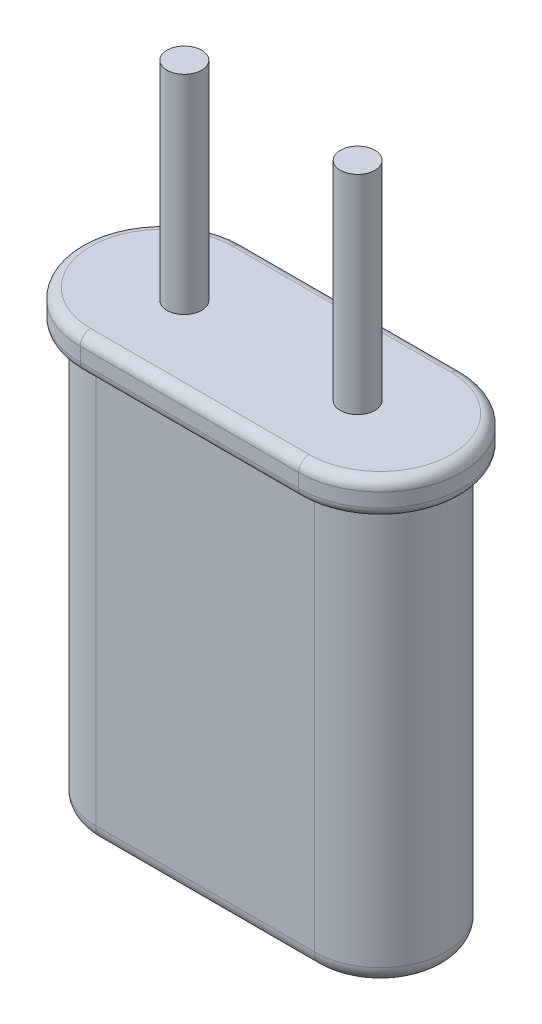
ISO-10303-21;
HEADER;
FILE_DESCRIPTION(('STEP AP214'),'2;1');
FILE_NAME('part.step','',(''),(''),'','','');
FILE_SCHEMA(('AUTOMOTIVE_DESIGN { 1 0 10303 214 1 1 1 1 }'));
ENDSEC;
DATA;
#1=APPLICATION_CONTEXT('core data for automotive mechanical design processes');
#2=APPLICATION_PROTOCOL_DEFINITION('international standard','automotive_design',2000,#1);
#3=PRODUCT_CONTEXT('',#1,'mechanical');
#4=PRODUCT('Part','Part','',(#3));
#5=PRODUCT_RELATED_PRODUCT_CATEGORY('part','',(#4));
#6=PRODUCT_DEFINITION_FORMATION('','',#4);
#7=PRODUCT_DEFINITION_CONTEXT('part definition',#1,'design');
#8=PRODUCT_DEFINITION('design','',#6,#7);
#9=PRODUCT_DEFINITION_SHAPE('','',#8);
#10=(LENGTH_UNIT() NAMED_UNIT(*) SI_UNIT(.MILLI.,.METRE.));
#11=(NAMED_UNIT(*) PLANE_ANGLE_UNIT() SI_UNIT($,.RADIAN.));
#12=(NAMED_UNIT(*) SI_UNIT($,.STERADIAN.) SOLID_ANGLE_UNIT());
#13=UNCERTAINTY_MEASURE_WITH_UNIT(LENGTH_MEASURE(1.E-05),#10,'distance_accuracy_value','');
#14=(GEOMETRIC_REPRESENTATION_CONTEXT(3) GLOBAL_UNCERTAINTY_ASSIGNED_CONTEXT((#13)) GLOBAL_UNIT_ASSIGNED_CONTEXT((#10,
#11,#12)) REPRESENTATION_CONTEXT('',''));
#15=CARTESIAN_POINT('',(0.,0.,0.));
#16=DIRECTION('',(0.,0.,1.));
#17=DIRECTION('',(1.,0.,0.));
#18=AXIS2_PLACEMENT_3D('',#15,#16,#17);
#19=CARTESIAN_POINT('',(3.15,0.,0.));
#20=DIRECTION('',(0.,1.,0.));
#21=DIRECTION('',(0.,0.,1.));
#22=AXIS2_PLACEMENT_3D('',#19,#20,#21);
#23=PLANE('',#22);
#24=CARTESIAN_POINT('',(-2.5,0.,0.));
#25=DIRECTION('',(0.,1.,0.));
#26=DIRECTION('',(0.,0.,1.));
#27=AXIS2_PLACEMENT_3D('',#24,#25,#26);
#28=CIRCLE('',#27,0.5);
#29=CARTESIAN_POINT('',(-2.5,0.,0.5));
#30=VERTEX_POINT('',#29);
#31=EDGE_CURVE('E272',#30,#30,#28,.T.);
#32=ORIENTED_EDGE('',*,*,#31,.F.);
#33=EDGE_LOOP('',(#32));
#34=FACE_BOUND('',#33,.T.);
#35=CARTESIAN_POINT('',(-3.15,0.,0.));
#36=DIRECTION('',(0.,1.,0.));
#37=DIRECTION('',(0.,0.,1.));
#38=AXIS2_PLACEMENT_3D('',#35,#36,#37);
#39=CIRCLE('',#38,2.05);
#40=CARTESIAN_POINT('',(-3.15,0.,-2.05));
#41=VERTEX_POINT('',#40);
#42=CARTESIAN_POINT('',(-3.15,0.,2.05));
#43=VERTEX_POINT('',#42);
#44=EDGE_CURVE('E183',#41,#43,#39,.T.);
#45=ORIENTED_EDGE('',*,*,#44,.T.);
#46=DIRECTION('',(1.,0.,0.));
#47=VECTOR('',#46,1.);
#48=CARTESIAN_POINT('',(3.15,0.,2.05));
#49=LINE('',#48,#47);
#50=CARTESIAN_POINT('',(3.15,0.,2.05));
#51=VERTEX_POINT('',#50);
#52=EDGE_CURVE('E185',#43,#51,#49,.T.);
#53=ORIENTED_EDGE('',*,*,#52,.T.);
#54=CARTESIAN_POINT('',(3.15,0.,0.));
#55=DIRECTION('',(0.,1.,0.));
#56=DIRECTION('',(0.,0.,1.));
#57=AXIS2_PLACEMENT_3D('',#54,#55,#56);
#58=CIRCLE('',#57,2.05);
#59=CARTESIAN_POINT('',(3.15,0.,-2.05));
#60=VERTEX_POINT('',#59);
#61=EDGE_CURVE('E171',#51,#60,#58,.T.);
#62=ORIENTED_EDGE('',*,*,#61,.T.);
#63=DIRECTION('',(-1.,0.,0.));
#64=VECTOR('',#63,1.);
#65=CARTESIAN_POINT('',(3.15,0.,-2.05));
#66=LINE('',#65,#64);
#67=EDGE_CURVE('E181',#60,#41,#66,.T.);
#68=ORIENTED_EDGE('',*,*,#67,.T.);
#69=EDGE_LOOP('',(#45,#53,#62,#68));
#70=FACE_BOUND('',#69,.T.);
#71=CARTESIAN_POINT('',(2.5,0.,0.));
#72=DIRECTION('',(0.,1.,0.));
#73=DIRECTION('',(0.,0.,-1.));
#74=AXIS2_PLACEMENT_3D('',#71,#72,#73);
#75=CIRCLE('',#74,0.5);
#76=CARTESIAN_POINT('',(2.5,0.,-0.5));
#77=VERTEX_POINT('',#76);
#78=EDGE_CURVE('E278',#77,#77,#75,.T.);
#79=ORIENTED_EDGE('',*,*,#78,.F.);
#80=EDGE_LOOP('',(#79));
#81=FACE_BOUND('',#80,.T.);
#82=ADVANCED_FACE('F32',(#34,#70,#81),#23,.T.);
#83=CARTESIAN_POINT('',(3.15,-1.,0.));
#84=DIRECTION('',(0.,1.,0.));
#85=DIRECTION('',(0.,0.,1.));
#86=AXIS2_PLACEMENT_3D('',#83,#84,#85);
#87=PLANE('',#86);
#88=CARTESIAN_POINT('',(3.15,-1.,0.));
#89=DIRECTION('',(0.,1.,0.));
#90=DIRECTION('',(0.,0.,1.));
#91=AXIS2_PLACEMENT_3D('',#88,#89,#90);
#92=CIRCLE('',#91,2.05);
#93=CARTESIAN_POINT('',(3.15,-1.,-2.05));
#94=VERTEX_POINT('',#93);
#95=CARTESIAN_POINT('',(3.15,-1.,2.05));
#96=VERTEX_POINT('',#95);
#97=EDGE_CURVE('E208',#94,#96,#92,.F.);
#98=ORIENTED_EDGE('',*,*,#97,.T.);
#99=DIRECTION('',(1.,0.,0.));
#100=VECTOR('',#99,1.);
#101=CARTESIAN_POINT('',(-3.15,-1.,2.05));
#102=LINE('',#101,#100);
#103=CARTESIAN_POINT('',(-3.15,-1.,2.05));
#104=VERTEX_POINT('',#103);
#105=EDGE_CURVE('E213',#96,#104,#102,.F.);
#106=ORIENTED_EDGE('',*,*,#105,.T.);
#107=CARTESIAN_POINT('',(-3.15,-1.,0.));
#108=DIRECTION('',(0.,1.,0.));
#109=DIRECTION('',(0.,0.,1.));
#110=AXIS2_PLACEMENT_3D('',#107,#108,#109);
#111=CIRCLE('',#110,2.05);
#112=CARTESIAN_POINT('',(-3.15,-1.,-2.05));
#113=VERTEX_POINT('',#112);
#114=EDGE_CURVE('E210',#104,#113,#111,.F.);
#115=ORIENTED_EDGE('',*,*,#114,.T.);
#116=DIRECTION('',(-1.,0.,0.));
#117=VECTOR('',#116,1.);
#118=CARTESIAN_POINT('',(3.15,-1.,-2.05));
#119=LINE('',#118,#117);
#120=EDGE_CURVE('E206',#113,#94,#119,.F.);
#121=ORIENTED_EDGE('',*,*,#120,.T.);
#122=EDGE_LOOP('',(#98,#106,#115,#121));
#123=FACE_BOUND('',#122,.T.);
#124=CARTESIAN_POINT('',(3.15,-1.,0.));
#125=DIRECTION('',(0.,-1.,0.));
#126=DIRECTION('',(0.,0.,-1.));
#127=AXIS2_PLACEMENT_3D('',#124,#125,#126);
#128=CIRCLE('',#127,1.9);
#129=CARTESIAN_POINT('',(3.15,-1.,-1.9));
#130=VERTEX_POINT('',#129);
#131=CARTESIAN_POINT('',(3.15,-1.,1.9));
#132=VERTEX_POINT('',#131);
#133=EDGE_CURVE('E137',#130,#132,#128,.T.);
#134=ORIENTED_EDGE('',*,*,#133,.F.);
#135=DIRECTION('',(1.,0.,0.));
#136=VECTOR('',#135,1.);
#137=CARTESIAN_POINT('',(-3.15,-1.,-1.9));
#138=LINE('',#137,#136);
#139=CARTESIAN_POINT('',(-3.15,-1.,-1.9));
#140=VERTEX_POINT('',#139);
#141=EDGE_CURVE('E144',#140,#130,#138,.T.);
#142=ORIENTED_EDGE('',*,*,#141,.F.);
#143=CARTESIAN_POINT('',(-3.15,-1.,0.));
#144=DIRECTION('',(0.,-1.,0.));
#145=DIRECTION('',(0.,0.,-1.));
#146=AXIS2_PLACEMENT_3D('',#143,#144,#145);
#147=CIRCLE('',#146,1.9);
#148=CARTESIAN_POINT('',(-3.15,-1.,1.9));
#149=VERTEX_POINT('',#148);
#150=EDGE_CURVE('E157',#149,#140,#147,.T.);
#151=ORIENTED_EDGE('',*,*,#150,.F.);
#152=DIRECTION('',(-1.,0.,0.));
#153=VECTOR('',#152,1.);
#154=CARTESIAN_POINT('',(3.15,-1.,1.9));
#155=LINE('',#154,#153);
#156=EDGE_CURVE('E153',#132,#149,#155,.T.);
#157=ORIENTED_EDGE('',*,*,#156,.F.);
#158=EDGE_LOOP('',(#134,#142,#151,#157));
#159=FACE_BOUND('',#158,.T.);
#160=ADVANCED_FACE('F149',(#123,#159),#87,.F.);
#161=CARTESIAN_POINT('',(3.15,-1.,0.));
#162=DIRECTION('',(0.,1.,0.));
#163=DIRECTION('',(0.,0.,1.));
#164=AXIS2_PLACEMENT_3D('',#161,#162,#163);
#165=CYLINDRICAL_SURFACE('',#164,2.35);
#166=DIRECTION('',(0.,1.,0.));
#167=VECTOR('',#166,1.);
#168=CARTESIAN_POINT('',(3.15,-1.,-2.35));
#169=LINE('',#168,#167);
#170=CARTESIAN_POINT('',(3.15,-0.7,-2.35));
#171=VERTEX_POINT('',#170);
#172=CARTESIAN_POINT('',(3.15,-0.3,-2.35));
#173=VERTEX_POINT('',#172);
#174=EDGE_CURVE('E167',#171,#173,#169,.T.);
#175=ORIENTED_EDGE('',*,*,#174,.T.);
#176=CARTESIAN_POINT('',(3.15,-0.3,0.));
#177=DIRECTION('',(0.,1.,0.));
#178=DIRECTION('',(0.,0.,1.));
#179=AXIS2_PLACEMENT_3D('',#176,#177,#178);
#180=CIRCLE('',#179,2.35);
#181=CARTESIAN_POINT('',(3.15,-0.3,2.35));
#182=VERTEX_POINT('',#181);
#183=EDGE_CURVE('E204',#173,#182,#180,.F.);
#184=ORIENTED_EDGE('',*,*,#183,.T.);
#185=DIRECTION('',(0.,1.,0.));
#186=VECTOR('',#185,1.);
#187=CARTESIAN_POINT('',(3.15,-1.,2.35));
#188=LINE('',#187,#186);
#189=CARTESIAN_POINT('',(3.15,-0.7,2.35));
#190=VERTEX_POINT('',#189);
#191=EDGE_CURVE('E168',#190,#182,#188,.T.);
#192=ORIENTED_EDGE('',*,*,#191,.F.);
#193=CARTESIAN_POINT('',(3.15,-0.7,0.));
#194=DIRECTION('',(0.,1.,0.));
#195=DIRECTION('',(0.,0.,1.));
#196=AXIS2_PLACEMENT_3D('',#193,#194,#195);
#197=CIRCLE('',#196,2.35);
#198=EDGE_CURVE('E202',#190,#171,#197,.T.);
#199=ORIENTED_EDGE('',*,*,#198,.T.);
#200=EDGE_LOOP('',(#175,#184,#192,#199));
#201=FACE_BOUND('',#200,.T.);
#202=ADVANCED_FACE('F299',(#201),#165,.T.);
#203=CARTESIAN_POINT('',(-3.15,-1.,2.35));
#204=DIRECTION('',(0.,0.,1.));
#205=DIRECTION('',(1.,0.,0.));
#206=AXIS2_PLACEMENT_3D('',#203,#204,#205);
#207=PLANE('',#206);
#208=ORIENTED_EDGE('',*,*,#191,.T.);
#209=DIRECTION('',(1.,0.,0.));
#210=VECTOR('',#209,1.);
#211=CARTESIAN_POINT('',(-3.15,-0.3,2.35));
#212=LINE('',#211,#210);
#213=CARTESIAN_POINT('',(-3.15,-0.3,2.35));
#214=VERTEX_POINT('',#213);
#215=EDGE_CURVE('E190',#182,#214,#212,.F.);
#216=ORIENTED_EDGE('',*,*,#215,.T.);
#217=DIRECTION('',(0.,1.,0.));
#218=VECTOR('',#217,1.);
#219=CARTESIAN_POINT('',(-3.15,-1.,2.35));
#220=LINE('',#219,#218);
#221=CARTESIAN_POINT('',(-3.15,-0.7,2.35));
#222=VERTEX_POINT('',#221);
#223=EDGE_CURVE('E172',#222,#214,#220,.T.);
#224=ORIENTED_EDGE('',*,*,#223,.F.);
#225=DIRECTION('',(1.,0.,0.));
#226=VECTOR('',#225,1.);
#227=CARTESIAN_POINT('',(3.15,-0.7,2.35));
#228=LINE('',#227,#226);
#229=EDGE_CURVE('E188',#222,#190,#228,.T.);
#230=ORIENTED_EDGE('',*,*,#229,.T.);
#231=EDGE_LOOP('',(#208,#216,#224,#230));
#232=FACE_BOUND('',#231,.T.);
#233=ADVANCED_FACE('F306',(#232),#207,.T.);
#234=CARTESIAN_POINT('',(-3.15,-1.,0.));
#235=DIRECTION('',(0.,1.,0.));
#236=DIRECTION('',(0.,0.,1.));
#237=AXIS2_PLACEMENT_3D('',#234,#235,#236);
#238=CYLINDRICAL_SURFACE('',#237,2.35);
#239=ORIENTED_EDGE('',*,*,#223,.T.);
#240=CARTESIAN_POINT('',(-3.15,-0.3,0.));
#241=DIRECTION('',(0.,1.,0.));
#242=DIRECTION('',(0.,0.,1.));
#243=AXIS2_PLACEMENT_3D('',#240,#241,#242);
#244=CIRCLE('',#243,2.35);
#245=CARTESIAN_POINT('',(-3.15,-0.3,-2.35));
#246=VERTEX_POINT('',#245);
#247=EDGE_CURVE('E196',#214,#246,#244,.F.);
#248=ORIENTED_EDGE('',*,*,#247,.T.);
#249=DIRECTION('',(0.,1.,0.));
#250=VECTOR('',#249,1.);
#251=CARTESIAN_POINT('',(-3.15,-1.,-2.35));
#252=LINE('',#251,#250);
#253=CARTESIAN_POINT('',(-3.15,-0.7,-2.35));
#254=VERTEX_POINT('',#253);
#255=EDGE_CURVE('E175',#254,#246,#252,.T.);
#256=ORIENTED_EDGE('',*,*,#255,.F.);
#257=CARTESIAN_POINT('',(-3.15,-0.7,0.));
#258=DIRECTION('',(0.,1.,0.));
#259=DIRECTION('',(0.,0.,1.));
#260=AXIS2_PLACEMENT_3D('',#257,#258,#259);
#261=CIRCLE('',#260,2.35);
#262=EDGE_CURVE('E193',#254,#222,#261,.T.);
#263=ORIENTED_EDGE('',*,*,#262,.T.);
#264=EDGE_LOOP('',(#239,#248,#256,#263));
#265=FACE_BOUND('',#264,.T.);
#266=ADVANCED_FACE('F309',(#265),#238,.T.);
#267=CARTESIAN_POINT('',(-3.15,-1.,-2.35));
#268=DIRECTION('',(0.,0.,-1.));
#269=DIRECTION('',(-1.,0.,0.));
#270=AXIS2_PLACEMENT_3D('',#267,#268,#269);
#271=PLANE('',#270);
#272=ORIENTED_EDGE('',*,*,#255,.T.);
#273=DIRECTION('',(-1.,0.,0.));
#274=VECTOR('',#273,1.);
#275=CARTESIAN_POINT('',(-3.15,-0.3,-2.35));
#276=LINE('',#275,#274);
#277=EDGE_CURVE('E200',#246,#173,#276,.F.);
#278=ORIENTED_EDGE('',*,*,#277,.T.);
#279=ORIENTED_EDGE('',*,*,#174,.F.);
#280=DIRECTION('',(-1.,0.,0.));
#281=VECTOR('',#280,1.);
#282=CARTESIAN_POINT('',(-3.15,-0.7,-2.35));
#283=LINE('',#282,#281);
#284=EDGE_CURVE('E198',#171,#254,#283,.T.);
#285=ORIENTED_EDGE('',*,*,#284,.T.);
#286=EDGE_LOOP('',(#272,#278,#279,#285));
#287=FACE_BOUND('',#286,.T.);
#288=ADVANCED_FACE('F313',(#287),#271,.T.);
#289=CARTESIAN_POINT('',(3.15,-13.,0.));
#290=DIRECTION('',(0.,1.,0.));
#291=DIRECTION('',(0.,0.,1.));
#292=AXIS2_PLACEMENT_3D('',#289,#290,#291);
#293=CYLINDRICAL_SURFACE('',#292,1.9);
#294=DIRECTION('',(0.,1.,0.));
#295=VECTOR('',#294,1.);
#296=CARTESIAN_POINT('',(3.15,-13.,1.9));
#297=LINE('',#296,#295);
#298=CARTESIAN_POINT('',(3.15,-12.5,1.9));
#299=VERTEX_POINT('',#298);
#300=EDGE_CURVE('E165',#299,#132,#297,.T.);
#301=ORIENTED_EDGE('',*,*,#300,.F.);
#302=CARTESIAN_POINT('',(3.15,-12.5,0.));
#303=DIRECTION('',(0.,-1.,0.));
#304=DIRECTION('',(0.,0.,-1.));
#305=AXIS2_PLACEMENT_3D('',#302,#303,#304);
#306=CIRCLE('',#305,1.9);
#307=CARTESIAN_POINT('',(3.15,-12.5,-1.9));
#308=VERTEX_POINT('',#307);
#309=EDGE_CURVE('E11',#299,#308,#306,.F.);
#310=ORIENTED_EDGE('',*,*,#309,.T.);
#311=DIRECTION('',(0.,1.,0.));
#312=VECTOR('',#311,1.);
#313=CARTESIAN_POINT('',(3.15,-13.,-1.9));
#314=LINE('',#313,#312);
#315=EDGE_CURVE('E134',#308,#130,#314,.T.);
#316=ORIENTED_EDGE('',*,*,#315,.T.);
#317=ORIENTED_EDGE('',*,*,#133,.T.);
#318=EDGE_LOOP('',(#301,#310,#316,#317));
#319=FACE_BOUND('',#318,.T.);
#320=ADVANCED_FACE('F136',(#319),#293,.T.);
#321=CARTESIAN_POINT('',(3.15,-13.,1.9));
#322=DIRECTION('',(0.,0.,-1.));
#323=DIRECTION('',(-1.,0.,0.));
#324=AXIS2_PLACEMENT_3D('',#321,#322,#323);
#325=PLANE('',#324);
#326=DIRECTION('',(0.,1.,0.));
#327=VECTOR('',#326,1.);
#328=CARTESIAN_POINT('',(-3.15,-13.,1.9));
#329=LINE('',#328,#327);
#330=CARTESIAN_POINT('',(-3.15,-12.5,1.9));
#331=VERTEX_POINT('',#330);
#332=EDGE_CURVE('E163',#331,#149,#329,.T.);
#333=ORIENTED_EDGE('',*,*,#332,.F.);
#334=DIRECTION('',(-1.,0.,0.));
#335=VECTOR('',#334,1.);
#336=CARTESIAN_POINT('',(3.15,-12.5,1.9));
#337=LINE('',#336,#335);
#338=EDGE_CURVE('E41',#331,#299,#337,.F.);
#339=ORIENTED_EDGE('',*,*,#338,.T.);
#340=ORIENTED_EDGE('',*,*,#300,.T.);
#341=ORIENTED_EDGE('',*,*,#156,.T.);
#342=EDGE_LOOP('',(#333,#339,#340,#341));
#343=FACE_BOUND('',#342,.T.);
#344=ADVANCED_FACE('F270',(#343),#325,.F.);
#345=CARTESIAN_POINT('',(-3.15,-13.,0.));
#346=DIRECTION('',(0.,1.,0.));
#347=DIRECTION('',(0.,0.,1.));
#348=AXIS2_PLACEMENT_3D('',#345,#346,#347);
#349=CYLINDRICAL_SURFACE('',#348,1.9);
#350=DIRECTION('',(0.,1.,0.));
#351=VECTOR('',#350,1.);
#352=CARTESIAN_POINT('',(-3.15,-13.,-1.9));
#353=LINE('',#352,#351);
#354=CARTESIAN_POINT('',(-3.15,-12.5,-1.9));
#355=VERTEX_POINT('',#354);
#356=EDGE_CURVE('E143',#355,#140,#353,.T.);
#357=ORIENTED_EDGE('',*,*,#356,.F.);
#358=CARTESIAN_POINT('',(-3.15,-12.5,0.));
#359=DIRECTION('',(0.,-1.,0.));
#360=DIRECTION('',(0.,0.,-1.));
#361=AXIS2_PLACEMENT_3D('',#358,#359,#360);
#362=CIRCLE('',#361,1.9);
#363=EDGE_CURVE('E56',#355,#331,#362,.F.);
#364=ORIENTED_EDGE('',*,*,#363,.T.);
#365=ORIENTED_EDGE('',*,*,#332,.T.);
#366=ORIENTED_EDGE('',*,*,#150,.T.);
#367=EDGE_LOOP('',(#357,#364,#365,#366));
#368=FACE_BOUND('',#367,.T.);
#369=ADVANCED_FACE('F269',(#368),#349,.T.);
#370=CARTESIAN_POINT('',(-3.15,-13.,-1.9));
#371=DIRECTION('',(0.,0.,1.));
#372=DIRECTION('',(1.,0.,0.));
#373=AXIS2_PLACEMENT_3D('',#370,#371,#372);
#374=PLANE('',#373);
#375=ORIENTED_EDGE('',*,*,#315,.F.);
#376=DIRECTION('',(1.,0.,0.));
#377=VECTOR('',#376,1.);
#378=CARTESIAN_POINT('',(-3.15,-12.5,-1.9));
#379=LINE('',#378,#377);
#380=EDGE_CURVE('E243',#308,#355,#379,.F.);
#381=ORIENTED_EDGE('',*,*,#380,.T.);
#382=ORIENTED_EDGE('',*,*,#356,.T.);
#383=ORIENTED_EDGE('',*,*,#141,.T.);
#384=EDGE_LOOP('',(#375,#381,#382,#383));
#385=FACE_BOUND('',#384,.T.);
#386=ADVANCED_FACE('F156',(#385),#374,.F.);
#387=CARTESIAN_POINT('',(3.15,-13.,0.));
#388=DIRECTION('',(0.,-1.,0.));
#389=DIRECTION('',(0.,0.,-1.));
#390=AXIS2_PLACEMENT_3D('',#387,#388,#389);
#391=PLANE('',#390);
#392=CARTESIAN_POINT('',(-3.15,-13.,0.));
#393=DIRECTION('',(0.,-1.,0.));
#394=DIRECTION('',(0.,0.,-1.));
#395=AXIS2_PLACEMENT_3D('',#392,#393,#394);
#396=CIRCLE('',#395,1.4);
#397=CARTESIAN_POINT('',(-3.15,-13.,1.4));
#398=VERTEX_POINT('',#397);
#399=CARTESIAN_POINT('',(-3.15,-13.,-1.4));
#400=VERTEX_POINT('',#399);
#401=EDGE_CURVE('E238',#398,#400,#396,.T.);
#402=ORIENTED_EDGE('',*,*,#401,.T.);
#403=DIRECTION('',(1.,0.,0.));
#404=VECTOR('',#403,1.);
#405=CARTESIAN_POINT('',(3.15,-13.,-1.4));
#406=LINE('',#405,#404);
#407=CARTESIAN_POINT('',(3.15,-13.,-1.4));
#408=VERTEX_POINT('',#407);
#409=EDGE_CURVE('E240',#400,#408,#406,.T.);
#410=ORIENTED_EDGE('',*,*,#409,.T.);
#411=CARTESIAN_POINT('',(3.15,-13.,0.));
#412=DIRECTION('',(0.,-1.,0.));
#413=DIRECTION('',(0.,0.,-1.));
#414=AXIS2_PLACEMENT_3D('',#411,#412,#413);
#415=CIRCLE('',#414,1.4);
#416=CARTESIAN_POINT('',(3.15,-13.,1.4));
#417=VERTEX_POINT('',#416);
#418=EDGE_CURVE('E215',#408,#417,#415,.T.);
#419=ORIENTED_EDGE('',*,*,#418,.T.);
#420=DIRECTION('',(-1.,0.,0.));
#421=VECTOR('',#420,1.);
#422=CARTESIAN_POINT('',(-3.15,-13.,1.4));
#423=LINE('',#422,#421);
#424=EDGE_CURVE('E236',#417,#398,#423,.T.);
#425=ORIENTED_EDGE('',*,*,#424,.T.);
#426=EDGE_LOOP('',(#402,#410,#419,#425));
#427=FACE_BOUND('',#426,.T.);
#428=ADVANCED_FACE('F337',(#427),#391,.T.);
#429=CARTESIAN_POINT('',(3.15,-0.3,-2.05));
#430=DIRECTION('',(-1.,0.,0.));
#431=DIRECTION('',(0.,0.,1.));
#432=AXIS2_PLACEMENT_3D('',#429,#430,#431);
#433=CYLINDRICAL_SURFACE('',#432,0.3);
#434=CARTESIAN_POINT('',(3.15,-0.3,-2.05));
#435=DIRECTION('',(1.,0.,0.));
#436=DIRECTION('',(0.,0.,-1.));
#437=AXIS2_PLACEMENT_3D('',#434,#435,#436);
#438=CIRCLE('',#437,0.3);
#439=EDGE_CURVE('E221',#173,#60,#438,.T.);
#440=ORIENTED_EDGE('',*,*,#439,.F.);
#441=ORIENTED_EDGE('',*,*,#277,.F.);
#442=CARTESIAN_POINT('',(-3.15,-0.3,-2.05));
#443=DIRECTION('',(-1.,0.,0.));
#444=DIRECTION('',(0.,0.,1.));
#445=AXIS2_PLACEMENT_3D('',#442,#443,#444);
#446=CIRCLE('',#445,0.3);
#447=EDGE_CURVE('E154',#41,#246,#446,.T.);
#448=ORIENTED_EDGE('',*,*,#447,.F.);
#449=ORIENTED_EDGE('',*,*,#67,.F.);
#450=EDGE_LOOP('',(#440,#441,#448,#449));
#451=FACE_BOUND('',#450,.T.);
#452=ADVANCED_FACE('F333',(#451),#433,.T.);
#453=CARTESIAN_POINT('',(-3.15,-0.3,0.));
#454=DIRECTION('',(0.,1.,0.));
#455=DIRECTION('',(0.,0.,1.));
#456=AXIS2_PLACEMENT_3D('',#453,#454,#455);
#457=TOROIDAL_SURFACE('',#456,2.05,0.3);
#458=ORIENTED_EDGE('',*,*,#447,.T.);
#459=ORIENTED_EDGE('',*,*,#247,.F.);
#460=CARTESIAN_POINT('',(-3.15,-0.3,2.05));
#461=DIRECTION('',(1.,0.,0.));
#462=DIRECTION('',(0.,0.,-1.));
#463=AXIS2_PLACEMENT_3D('',#460,#461,#462);
#464=CIRCLE('',#463,0.3);
#465=EDGE_CURVE('E218',#43,#214,#464,.T.);
#466=ORIENTED_EDGE('',*,*,#465,.F.);
#467=ORIENTED_EDGE('',*,*,#44,.F.);
#468=EDGE_LOOP('',(#458,#459,#466,#467));
#469=FACE_BOUND('',#468,.T.);
#470=ADVANCED_FACE('F329',(#469),#457,.T.);
#471=CARTESIAN_POINT('',(3.15,-0.3,0.));
#472=DIRECTION('',(0.,1.,0.));
#473=DIRECTION('',(0.,0.,1.));
#474=AXIS2_PLACEMENT_3D('',#471,#472,#473);
#475=TOROIDAL_SURFACE('',#474,2.05,0.3);
#476=ORIENTED_EDGE('',*,*,#439,.T.);
#477=ORIENTED_EDGE('',*,*,#61,.F.);
#478=CARTESIAN_POINT('',(3.15,-0.3,2.05));
#479=DIRECTION('',(-1.,0.,0.));
#480=DIRECTION('',(0.,0.,1.));
#481=AXIS2_PLACEMENT_3D('',#478,#479,#480);
#482=CIRCLE('',#481,0.3);
#483=EDGE_CURVE('E216',#182,#51,#482,.T.);
#484=ORIENTED_EDGE('',*,*,#483,.F.);
#485=ORIENTED_EDGE('',*,*,#183,.F.);
#486=EDGE_LOOP('',(#476,#477,#484,#485));
#487=FACE_BOUND('',#486,.T.);
#488=ADVANCED_FACE('F325',(#487),#475,.T.);
#489=CARTESIAN_POINT('',(3.15,-0.3,2.05));
#490=DIRECTION('',(1.,0.,0.));
#491=DIRECTION('',(0.,0.,-1.));
#492=AXIS2_PLACEMENT_3D('',#489,#490,#491);
#493=CYLINDRICAL_SURFACE('',#492,0.3);
#494=ORIENTED_EDGE('',*,*,#465,.T.);
#495=ORIENTED_EDGE('',*,*,#215,.F.);
#496=ORIENTED_EDGE('',*,*,#483,.T.);
#497=ORIENTED_EDGE('',*,*,#52,.F.);
#498=EDGE_LOOP('',(#494,#495,#496,#497));
#499=FACE_BOUND('',#498,.T.);
#500=ADVANCED_FACE('F321',(#499),#493,.T.);
#501=CARTESIAN_POINT('',(3.15,-0.7,0.));
#502=DIRECTION('',(0.,1.,0.));
#503=DIRECTION('',(0.,0.,1.));
#504=AXIS2_PLACEMENT_3D('',#501,#502,#503);
#505=TOROIDAL_SURFACE('',#504,2.05,0.3);
#506=CARTESIAN_POINT('',(3.15,-0.7,2.05));
#507=DIRECTION('',(-1.,0.,0.));
#508=DIRECTION('',(0.,0.,1.));
#509=AXIS2_PLACEMENT_3D('',#506,#507,#508);
#510=CIRCLE('',#509,0.3);
#511=EDGE_CURVE('E230',#96,#190,#510,.T.);
#512=ORIENTED_EDGE('',*,*,#511,.F.);
#513=ORIENTED_EDGE('',*,*,#97,.F.);
#514=CARTESIAN_POINT('',(3.15,-0.7,-2.05));
#515=DIRECTION('',(-1.,0.,0.));
#516=DIRECTION('',(0.,0.,1.));
#517=AXIS2_PLACEMENT_3D('',#514,#515,#516);
#518=CIRCLE('',#517,0.3);
#519=EDGE_CURVE('E219',#171,#94,#518,.T.);
#520=ORIENTED_EDGE('',*,*,#519,.F.);
#521=ORIENTED_EDGE('',*,*,#198,.F.);
#522=EDGE_LOOP('',(#512,#513,#520,#521));
#523=FACE_BOUND('',#522,.T.);
#524=ADVANCED_FACE('F324',(#523),#505,.T.);
#525=CARTESIAN_POINT('',(-3.15,-0.7,-2.05));
#526=DIRECTION('',(1.,0.,0.));
#527=DIRECTION('',(0.,0.,-1.));
#528=AXIS2_PLACEMENT_3D('',#525,#526,#527);
#529=CYLINDRICAL_SURFACE('',#528,0.3);
#530=ORIENTED_EDGE('',*,*,#519,.T.);
#531=ORIENTED_EDGE('',*,*,#120,.F.);
#532=CARTESIAN_POINT('',(-3.15,-0.7,-2.05));
#533=DIRECTION('',(-1.,0.,0.));
#534=DIRECTION('',(0.,0.,1.));
#535=AXIS2_PLACEMENT_3D('',#532,#533,#534);
#536=CIRCLE('',#535,0.3);
#537=EDGE_CURVE('E228',#254,#113,#536,.T.);
#538=ORIENTED_EDGE('',*,*,#537,.F.);
#539=ORIENTED_EDGE('',*,*,#284,.F.);
#540=EDGE_LOOP('',(#530,#531,#538,#539));
#541=FACE_BOUND('',#540,.T.);
#542=ADVANCED_FACE('F346',(#541),#529,.T.);
#543=CARTESIAN_POINT('',(-3.15,-0.7,2.05));
#544=DIRECTION('',(-1.,0.,0.));
#545=DIRECTION('',(0.,0.,1.));
#546=AXIS2_PLACEMENT_3D('',#543,#544,#545);
#547=CYLINDRICAL_SURFACE('',#546,0.3);
#548=ORIENTED_EDGE('',*,*,#511,.T.);
#549=ORIENTED_EDGE('',*,*,#229,.F.);
#550=CARTESIAN_POINT('',(-3.15,-0.7,2.05));
#551=DIRECTION('',(-1.,0.,0.));
#552=DIRECTION('',(0.,0.,1.));
#553=AXIS2_PLACEMENT_3D('',#550,#551,#552);
#554=CIRCLE('',#553,0.3);
#555=EDGE_CURVE('E226',#104,#222,#554,.T.);
#556=ORIENTED_EDGE('',*,*,#555,.F.);
#557=ORIENTED_EDGE('',*,*,#105,.F.);
#558=EDGE_LOOP('',(#548,#549,#556,#557));
#559=FACE_BOUND('',#558,.T.);
#560=ADVANCED_FACE('F342',(#559),#547,.T.);
#561=CARTESIAN_POINT('',(-3.15,-0.7,0.));
#562=DIRECTION('',(0.,1.,0.));
#563=DIRECTION('',(0.,0.,1.));
#564=AXIS2_PLACEMENT_3D('',#561,#562,#563);
#565=TOROIDAL_SURFACE('',#564,2.05,0.3);
#566=ORIENTED_EDGE('',*,*,#537,.T.);
#567=ORIENTED_EDGE('',*,*,#114,.F.);
#568=ORIENTED_EDGE('',*,*,#555,.T.);
#569=ORIENTED_EDGE('',*,*,#262,.F.);
#570=EDGE_LOOP('',(#566,#567,#568,#569));
#571=FACE_BOUND('',#570,.T.);
#572=ADVANCED_FACE('F339',(#571),#565,.T.);
#573=CARTESIAN_POINT('',(3.15,-12.5,1.4));
#574=DIRECTION('',(1.,0.,0.));
#575=DIRECTION('',(0.,0.,-1.));
#576=AXIS2_PLACEMENT_3D('',#573,#574,#575);
#577=CYLINDRICAL_SURFACE('',#576,0.5);
#578=CARTESIAN_POINT('',(3.15,-12.5,1.4));
#579=DIRECTION('',(1.,0.,0.));
#580=DIRECTION('',(0.,0.,-1.));
#581=AXIS2_PLACEMENT_3D('',#578,#579,#580);
#582=CIRCLE('',#581,0.5);
#583=EDGE_CURVE('E251',#299,#417,#582,.T.);
#584=ORIENTED_EDGE('',*,*,#583,.F.);
#585=ORIENTED_EDGE('',*,*,#338,.F.);
#586=CARTESIAN_POINT('',(-3.15,-12.5,1.4));
#587=DIRECTION('',(-1.,0.,0.));
#588=DIRECTION('',(0.,0.,1.));
#589=AXIS2_PLACEMENT_3D('',#586,#587,#588);
#590=CIRCLE('',#589,0.5);
#591=EDGE_CURVE('E36',#398,#331,#590,.T.);
#592=ORIENTED_EDGE('',*,*,#591,.F.);
#593=ORIENTED_EDGE('',*,*,#424,.F.);
#594=EDGE_LOOP('',(#584,#585,#592,#593));
#595=FACE_BOUND('',#594,.T.);
#596=ADVANCED_FACE('F34',(#595),#577,.T.);
#597=CARTESIAN_POINT('',(-3.15,-12.5,0.));
#598=DIRECTION('',(0.,-1.,0.));
#599=DIRECTION('',(0.,0.,-1.));
#600=AXIS2_PLACEMENT_3D('',#597,#598,#599);
#601=TOROIDAL_SURFACE('',#600,1.4,0.5);
#602=ORIENTED_EDGE('',*,*,#591,.T.);
#603=ORIENTED_EDGE('',*,*,#363,.F.);
#604=CARTESIAN_POINT('',(-3.15,-12.5,-1.4));
#605=DIRECTION('',(1.,0.,0.));
#606=DIRECTION('',(0.,0.,-1.));
#607=AXIS2_PLACEMENT_3D('',#604,#605,#606);
#608=CIRCLE('',#607,0.5);
#609=EDGE_CURVE('E249',#400,#355,#608,.T.);
#610=ORIENTED_EDGE('',*,*,#609,.F.);
#611=ORIENTED_EDGE('',*,*,#401,.F.);
#612=EDGE_LOOP('',(#602,#603,#610,#611));
#613=FACE_BOUND('',#612,.T.);
#614=ADVANCED_FACE('F260',(#613),#601,.T.);
#615=CARTESIAN_POINT('',(3.15,-12.5,0.));
#616=DIRECTION('',(0.,-1.,0.));
#617=DIRECTION('',(0.,0.,-1.));
#618=AXIS2_PLACEMENT_3D('',#615,#616,#617);
#619=TOROIDAL_SURFACE('',#618,1.4,0.5);
#620=ORIENTED_EDGE('',*,*,#583,.T.);
#621=ORIENTED_EDGE('',*,*,#418,.F.);
#622=CARTESIAN_POINT('',(3.15,-12.5,-1.4));
#623=DIRECTION('',(-1.,0.,0.));
#624=DIRECTION('',(0.,0.,1.));
#625=AXIS2_PLACEMENT_3D('',#622,#623,#624);
#626=CIRCLE('',#625,0.5);
#627=EDGE_CURVE('E247',#308,#408,#626,.T.);
#628=ORIENTED_EDGE('',*,*,#627,.F.);
#629=ORIENTED_EDGE('',*,*,#309,.F.);
#630=EDGE_LOOP('',(#620,#621,#628,#629));
#631=FACE_BOUND('',#630,.T.);
#632=ADVANCED_FACE('F265',(#631),#619,.T.);
#633=CARTESIAN_POINT('',(3.15,-12.5,-1.4));
#634=DIRECTION('',(-1.,0.,0.));
#635=DIRECTION('',(0.,0.,1.));
#636=AXIS2_PLACEMENT_3D('',#633,#634,#635);
#637=CYLINDRICAL_SURFACE('',#636,0.5);
#638=ORIENTED_EDGE('',*,*,#609,.T.);
#639=ORIENTED_EDGE('',*,*,#380,.F.);
#640=ORIENTED_EDGE('',*,*,#627,.T.);
#641=ORIENTED_EDGE('',*,*,#409,.F.);
#642=EDGE_LOOP('',(#638,#639,#640,#641));
#643=FACE_BOUND('',#642,.T.);
#644=ADVANCED_FACE('F268',(#643),#637,.T.);
#645=CARTESIAN_POINT('',(-2.5,6.,0.));
#646=DIRECTION('',(0.,-1.,0.));
#647=DIRECTION('',(0.,0.,-1.));
#648=AXIS2_PLACEMENT_3D('',#645,#646,#647);
#649=CYLINDRICAL_SURFACE('',#648,0.5);
#650=CARTESIAN_POINT('',(-2.5,6.,0.));
#651=DIRECTION('',(0.,1.,0.));
#652=DIRECTION('',(0.,0.,1.));
#653=AXIS2_PLACEMENT_3D('',#650,#651,#652);
#654=CIRCLE('',#653,0.5);
#655=CARTESIAN_POINT('',(-2.5,6.,0.5));
#656=VERTEX_POINT('',#655);
#657=EDGE_CURVE('E250',#656,#656,#654,.T.);
#658=ORIENTED_EDGE('',*,*,#657,.F.);
#659=EDGE_LOOP('',(#658));
#660=FACE_BOUND('',#659,.T.);
#661=ORIENTED_EDGE('',*,*,#31,.T.);
#662=EDGE_LOOP('',(#661));
#663=FACE_BOUND('',#662,.T.);
#664=ADVANCED_FACE('F356',(#660,#663),#649,.T.);
#665=CARTESIAN_POINT('',(-2.5,6.,0.));
#666=DIRECTION('',(0.,1.,0.));
#667=DIRECTION('',(0.,0.,1.));
#668=AXIS2_PLACEMENT_3D('',#665,#666,#667);
#669=PLANE('',#668);
#670=ORIENTED_EDGE('',*,*,#657,.T.);
#671=EDGE_LOOP('',(#670));
#672=FACE_BOUND('',#671,.T.);
#673=ADVANCED_FACE('F289',(#672),#669,.T.);
#674=CARTESIAN_POINT('',(2.5,6.,0.));
#675=DIRECTION('',(0.,-1.,0.));
#676=DIRECTION('',(0.,0.,-1.));
#677=AXIS2_PLACEMENT_3D('',#674,#675,#676);
#678=CYLINDRICAL_SURFACE('',#677,0.5);
#679=CARTESIAN_POINT('',(2.5,6.,0.));
#680=DIRECTION('',(0.,1.,0.));
#681=DIRECTION('',(0.,0.,-1.));
#682=AXIS2_PLACEMENT_3D('',#679,#680,#681);
#683=CIRCLE('',#682,0.5);
#684=CARTESIAN_POINT('',(2.5,6.,-0.5));
#685=VERTEX_POINT('',#684);
#686=EDGE_CURVE('E275',#685,#685,#683,.T.);
#687=ORIENTED_EDGE('',*,*,#686,.F.);
#688=EDGE_LOOP('',(#687));
#689=FACE_BOUND('',#688,.T.);
#690=ORIENTED_EDGE('',*,*,#78,.T.);
#691=EDGE_LOOP('',(#690));
#692=FACE_BOUND('',#691,.T.);
#693=ADVANCED_FACE('F286',(#689,#692),#678,.T.);
#694=CARTESIAN_POINT('',(2.5,6.,0.));
#695=DIRECTION('',(0.,-1.,0.));
#696=DIRECTION('',(0.,0.,-1.));
#697=AXIS2_PLACEMENT_3D('',#694,#695,#696);
#698=PLANE('',#697);
#699=ORIENTED_EDGE('',*,*,#686,.T.);
#700=EDGE_LOOP('',(#699));
#701=FACE_BOUND('',#700,.T.);
#702=ADVANCED_FACE('F284',(#701),#698,.F.);
#703=CLOSED_SHELL('',(#82,#160,#202,#233,#266,#288,#320,#344,#369,#386,#428,#452,#470,#488,#500,
#524,#542,#560,#572,#596,#614,#632,#644,#664,#673,#693,#702));
#704=MANIFOLD_SOLID_BREP('B2',#703);
#705=ADVANCED_BREP_SHAPE_REPRESENTATION('',(#18,#704),#14);
#706=SHAPE_DEFINITION_REPRESENTATION(#9,#705);
ENDSEC;
END-ISO-10303-21;
